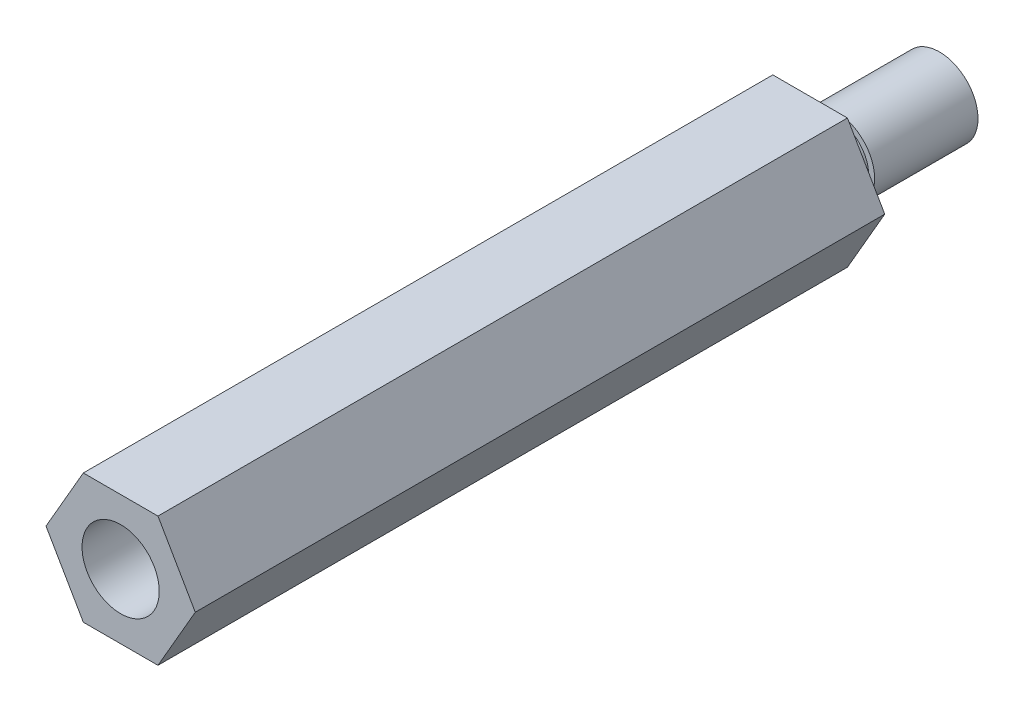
ISO-10303-21;
HEADER;
FILE_DESCRIPTION(('STEP AP214'),'2;1');
FILE_NAME('part.step','',(''),(''),'','','');
FILE_SCHEMA(('AUTOMOTIVE_DESIGN { 1 0 10303 214 1 1 1 1 }'));
ENDSEC;
DATA;
#1=APPLICATION_CONTEXT('core data for automotive mechanical design processes');
#2=APPLICATION_PROTOCOL_DEFINITION('international standard','automotive_design',2000,#1);
#3=PRODUCT_CONTEXT('',#1,'mechanical');
#4=PRODUCT('Part','Part','',(#3));
#5=PRODUCT_RELATED_PRODUCT_CATEGORY('part','',(#4));
#6=PRODUCT_DEFINITION_FORMATION('','',#4);
#7=PRODUCT_DEFINITION_CONTEXT('part definition',#1,'design');
#8=PRODUCT_DEFINITION('design','',#6,#7);
#9=PRODUCT_DEFINITION_SHAPE('','',#8);
#10=(LENGTH_UNIT() NAMED_UNIT(*) SI_UNIT(.MILLI.,.METRE.));
#11=(NAMED_UNIT(*) PLANE_ANGLE_UNIT() SI_UNIT($,.RADIAN.));
#12=(NAMED_UNIT(*) SI_UNIT($,.STERADIAN.) SOLID_ANGLE_UNIT());
#13=UNCERTAINTY_MEASURE_WITH_UNIT(LENGTH_MEASURE(1.E-05),#10,'distance_accuracy_value','');
#14=(GEOMETRIC_REPRESENTATION_CONTEXT(3) GLOBAL_UNCERTAINTY_ASSIGNED_CONTEXT((#13)) GLOBAL_UNIT_ASSIGNED_CONTEXT((#10,
#11,#12)) REPRESENTATION_CONTEXT('',''));
#15=CARTESIAN_POINT('',(0.,0.,0.));
#16=DIRECTION('',(0.,0.,1.));
#17=DIRECTION('',(1.,0.,0.));
#18=AXIS2_PLACEMENT_3D('',#15,#16,#17);
#19=CARTESIAN_POINT('',(-4.12444598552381,-2.38124999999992,0.));
#20=DIRECTION('',(0.,0.,1.));
#21=DIRECTION('',(1.,0.,0.));
#22=AXIS2_PLACEMENT_3D('',#19,#20,#21);
#23=PLANE('',#22);
#24=DIRECTION('',(-0.500000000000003,-0.866025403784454,0.));
#25=VECTOR('',#24,1.);
#26=CARTESIAN_POINT('',(-2.74963065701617,-1.66533453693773E-13,1.66533453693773E-13));
#27=LINE('',#26,#25);
#28=CARTESIAN_POINT('',(-1.37481532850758,2.38124999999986,0.));
#29=VERTEX_POINT('',#28);
#30=CARTESIAN_POINT('',(-2.74963065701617,-1.66533453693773E-13,1.66533453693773E-13));
#31=VERTEX_POINT('',#30);
#32=EDGE_CURVE('E83',#29,#31,#27,.T.);
#33=ORIENTED_EDGE('',*,*,#32,.F.);
#34=DIRECTION('',(-1.,0.,0.));
#35=VECTOR('',#34,1.);
#36=CARTESIAN_POINT('',(-1.37481532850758,2.38124999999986,0.));
#37=LINE('',#36,#35);
#38=CARTESIAN_POINT('',(1.37481532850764,2.38125000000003,1.38777878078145E-13));
#39=VERTEX_POINT('',#38);
#40=EDGE_CURVE('E109',#39,#29,#37,.T.);
#41=ORIENTED_EDGE('',*,*,#40,.F.);
#42=DIRECTION('',(-0.499999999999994,0.866025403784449,0.));
#43=VECTOR('',#42,1.);
#44=CARTESIAN_POINT('',(1.37481532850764,2.38125000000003,1.38777878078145E-13));
#45=LINE('',#44,#43);
#46=CARTESIAN_POINT('',(2.74963065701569,0.,0.));
#47=VERTEX_POINT('',#46);
#48=EDGE_CURVE('E107',#47,#39,#45,.T.);
#49=ORIENTED_EDGE('',*,*,#48,.F.);
#50=DIRECTION('',(0.500000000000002,0.866025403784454,0.));
#51=VECTOR('',#50,1.);
#52=CARTESIAN_POINT('',(2.74963065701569,0.,0.));
#53=LINE('',#52,#51);
#54=CARTESIAN_POINT('',(1.37481532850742,-2.38124999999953,1.80411241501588E-13));
#55=VERTEX_POINT('',#54);
#56=EDGE_CURVE('E105',#55,#47,#53,.T.);
#57=ORIENTED_EDGE('',*,*,#56,.F.);
#58=DIRECTION('',(1.,0.,0.));
#59=VECTOR('',#58,1.);
#60=CARTESIAN_POINT('',(1.37481532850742,-2.38124999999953,1.80411241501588E-13));
#61=LINE('',#60,#59);
#62=CARTESIAN_POINT('',(-1.37481532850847,-2.38124999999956,0.));
#63=VERTEX_POINT('',#62);
#64=EDGE_CURVE('E85',#63,#55,#61,.T.);
#65=ORIENTED_EDGE('',*,*,#64,.F.);
#66=DIRECTION('',(0.499999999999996,-0.866025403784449,0.));
#67=VECTOR('',#66,1.);
#68=CARTESIAN_POINT('',(-1.37481532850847,-2.38124999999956,0.));
#69=LINE('',#68,#67);
#70=EDGE_CURVE('E79',#31,#63,#69,.T.);
#71=ORIENTED_EDGE('',*,*,#70,.F.);
#72=EDGE_LOOP('',(#33,#41,#49,#57,#65,#71));
#73=FACE_BOUND('',#72,.T.);
#74=CARTESIAN_POINT('',(0.,3.05311331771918E-13,0.));
#75=DIRECTION('',(0.,0.,-1.));
#76=DIRECTION('',(-1.,0.,0.));
#77=AXIS2_PLACEMENT_3D('',#74,#75,#76);
#78=CIRCLE('',#77,1.2065);
#79=CARTESIAN_POINT('',(1.20650000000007,2.18193328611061E-13,0.));
#80=VERTEX_POINT('',#79);
#81=EDGE_CURVE('E189',#80,#80,#78,.T.);
#82=ORIENTED_EDGE('',*,*,#81,.F.);
#83=EDGE_LOOP('',(#82));
#84=FACE_BOUND('',#83,.T.);
#85=ADVANCED_FACE('F26',(#73,#84),#23,.F.);
#86=CARTESIAN_POINT('',(-2.74963065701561,-1.66533453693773E-13,25.4000000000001));
#87=DIRECTION('',(0.866025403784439,-0.500000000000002,0.));
#88=DIRECTION('',(0.500000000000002,0.866025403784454,0.));
#89=AXIS2_PLACEMENT_3D('',#86,#87,#88);
#90=PLANE('',#89);
#91=ORIENTED_EDGE('',*,*,#32,.T.);
#92=DIRECTION('',(0.,0.,-1.));
#93=VECTOR('',#92,1.);
#94=CARTESIAN_POINT('',(-2.74963065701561,-1.66533453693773E-13,25.4000000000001));
#95=LINE('',#94,#93);
#96=CARTESIAN_POINT('',(-2.74963065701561,-1.66533453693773E-13,25.4000000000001));
#97=VERTEX_POINT('',#96);
#98=EDGE_CURVE('E11',#97,#31,#95,.T.);
#99=ORIENTED_EDGE('',*,*,#98,.F.);
#100=DIRECTION('',(-0.500000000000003,-0.866025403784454,0.));
#101=VECTOR('',#100,1.);
#102=CARTESIAN_POINT('',(-2.74963065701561,-1.66533453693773E-13,25.4000000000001));
#103=LINE('',#102,#101);
#104=CARTESIAN_POINT('',(-1.37481532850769,2.38125000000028,25.4000000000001));
#105=VERTEX_POINT('',#104);
#106=EDGE_CURVE('E111',#105,#97,#103,.T.);
#107=ORIENTED_EDGE('',*,*,#106,.F.);
#108=DIRECTION('',(0.,0.,-1.));
#109=VECTOR('',#108,1.);
#110=CARTESIAN_POINT('',(-1.37481532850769,2.38125000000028,25.4000000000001));
#111=LINE('',#110,#109);
#112=EDGE_CURVE('E96',#105,#29,#111,.T.);
#113=ORIENTED_EDGE('',*,*,#112,.T.);
#114=EDGE_LOOP('',(#91,#99,#107,#113));
#115=FACE_BOUND('',#114,.T.);
#116=ADVANCED_FACE('F28',(#115),#90,.F.);
#117=CARTESIAN_POINT('',(-1.37481532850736,-2.38124999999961,25.4000000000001));
#118=DIRECTION('',(0.866025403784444,0.500000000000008,0.));
#119=DIRECTION('',(-0.499999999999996,0.866025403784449,0.));
#120=AXIS2_PLACEMENT_3D('',#117,#118,#119);
#121=PLANE('',#120);
#122=ORIENTED_EDGE('',*,*,#70,.T.);
#123=DIRECTION('',(0.,0.,-1.));
#124=VECTOR('',#123,1.);
#125=CARTESIAN_POINT('',(-1.37481532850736,-2.38124999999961,25.4000000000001));
#126=LINE('',#125,#124);
#127=CARTESIAN_POINT('',(-1.37481532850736,-2.38124999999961,25.4000000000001));
#128=VERTEX_POINT('',#127);
#129=EDGE_CURVE('E34',#128,#63,#126,.T.);
#130=ORIENTED_EDGE('',*,*,#129,.F.);
#131=DIRECTION('',(0.499999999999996,-0.866025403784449,0.));
#132=VECTOR('',#131,1.);
#133=CARTESIAN_POINT('',(-1.37481532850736,-2.38124999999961,25.4000000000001));
#134=LINE('',#133,#132);
#135=EDGE_CURVE('E92',#97,#128,#134,.T.);
#136=ORIENTED_EDGE('',*,*,#135,.F.);
#137=ORIENTED_EDGE('',*,*,#98,.T.);
#138=EDGE_LOOP('',(#122,#130,#136,#137));
#139=FACE_BOUND('',#138,.T.);
#140=ADVANCED_FACE('F91',(#139),#121,.F.);
#141=CARTESIAN_POINT('',(1.37481532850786,-2.38124999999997,25.4));
#142=DIRECTION('',(0.,1.00000000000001,0.));
#143=DIRECTION('',(-1.,0.,0.));
#144=AXIS2_PLACEMENT_3D('',#141,#142,#143);
#145=PLANE('',#144);
#146=ORIENTED_EDGE('',*,*,#64,.T.);
#147=DIRECTION('',(0.,0.,-1.));
#148=VECTOR('',#147,1.);
#149=CARTESIAN_POINT('',(1.37481532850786,-2.38124999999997,25.4));
#150=LINE('',#149,#148);
#151=CARTESIAN_POINT('',(1.37481532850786,-2.38124999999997,25.4));
#152=VERTEX_POINT('',#151);
#153=EDGE_CURVE('E127',#152,#55,#150,.T.);
#154=ORIENTED_EDGE('',*,*,#153,.F.);
#155=DIRECTION('',(1.,0.,0.));
#156=VECTOR('',#155,1.);
#157=CARTESIAN_POINT('',(1.37481532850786,-2.38124999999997,25.4));
#158=LINE('',#157,#156);
#159=EDGE_CURVE('E114',#128,#152,#158,.T.);
#160=ORIENTED_EDGE('',*,*,#159,.F.);
#161=ORIENTED_EDGE('',*,*,#129,.T.);
#162=EDGE_LOOP('',(#146,#154,#160,#161));
#163=FACE_BOUND('',#162,.T.);
#164=ADVANCED_FACE('F131',(#163),#145,.F.);
#165=CARTESIAN_POINT('',(2.74963065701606,0.,25.4000000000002));
#166=DIRECTION('',(-0.86602540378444,0.499999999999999,0.));
#167=DIRECTION('',(-0.500000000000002,-0.866025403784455,0.));
#168=AXIS2_PLACEMENT_3D('',#165,#166,#167);
#169=PLANE('',#168);
#170=ORIENTED_EDGE('',*,*,#56,.T.);
#171=DIRECTION('',(0.,0.,-1.));
#172=VECTOR('',#171,1.);
#173=CARTESIAN_POINT('',(2.74963065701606,0.,25.4000000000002));
#174=LINE('',#173,#172);
#175=CARTESIAN_POINT('',(2.74963065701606,0.,25.4000000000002));
#176=VERTEX_POINT('',#175);
#177=EDGE_CURVE('E124',#176,#47,#174,.T.);
#178=ORIENTED_EDGE('',*,*,#177,.F.);
#179=DIRECTION('',(0.500000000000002,0.866025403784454,0.));
#180=VECTOR('',#179,1.);
#181=CARTESIAN_POINT('',(2.74963065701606,0.,25.4000000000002));
#182=LINE('',#181,#180);
#183=EDGE_CURVE('E116',#152,#176,#182,.T.);
#184=ORIENTED_EDGE('',*,*,#183,.F.);
#185=ORIENTED_EDGE('',*,*,#153,.T.);
#186=EDGE_LOOP('',(#170,#178,#184,#185));
#187=FACE_BOUND('',#186,.T.);
#188=ADVANCED_FACE('F137',(#187),#169,.F.);
#189=CARTESIAN_POINT('',(1.37481532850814,2.38124999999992,25.4));
#190=DIRECTION('',(-0.866025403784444,-0.500000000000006,0.));
#191=DIRECTION('',(0.499999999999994,-0.866025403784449,0.));
#192=AXIS2_PLACEMENT_3D('',#189,#190,#191);
#193=PLANE('',#192);
#194=ORIENTED_EDGE('',*,*,#48,.T.);
#195=DIRECTION('',(0.,0.,-1.));
#196=VECTOR('',#195,1.);
#197=CARTESIAN_POINT('',(1.37481532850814,2.38124999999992,25.4));
#198=LINE('',#197,#196);
#199=CARTESIAN_POINT('',(1.37481532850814,2.38124999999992,25.4));
#200=VERTEX_POINT('',#199);
#201=EDGE_CURVE('E121',#200,#39,#198,.T.);
#202=ORIENTED_EDGE('',*,*,#201,.F.);
#203=DIRECTION('',(-0.499999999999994,0.866025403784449,0.));
#204=VECTOR('',#203,1.);
#205=CARTESIAN_POINT('',(1.37481532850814,2.38124999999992,25.4));
#206=LINE('',#205,#204);
#207=EDGE_CURVE('E46',#176,#200,#206,.T.);
#208=ORIENTED_EDGE('',*,*,#207,.F.);
#209=ORIENTED_EDGE('',*,*,#177,.T.);
#210=EDGE_LOOP('',(#194,#202,#208,#209));
#211=FACE_BOUND('',#210,.T.);
#212=ADVANCED_FACE('F140',(#211),#193,.F.);
#213=CARTESIAN_POINT('',(-1.37481532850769,2.38125000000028,25.4000000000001));
#214=DIRECTION('',(0.,-1.00000000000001,0.));
#215=DIRECTION('',(0.,0.,-1.));
#216=AXIS2_PLACEMENT_3D('',#213,#214,#215);
#217=PLANE('',#216);
#218=ORIENTED_EDGE('',*,*,#40,.T.);
#219=ORIENTED_EDGE('',*,*,#112,.F.);
#220=DIRECTION('',(-1.,0.,0.));
#221=VECTOR('',#220,1.);
#222=CARTESIAN_POINT('',(-1.37481532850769,2.38125000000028,25.4000000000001));
#223=LINE('',#222,#221);
#224=EDGE_CURVE('E41',#200,#105,#223,.T.);
#225=ORIENTED_EDGE('',*,*,#224,.F.);
#226=ORIENTED_EDGE('',*,*,#201,.T.);
#227=EDGE_LOOP('',(#218,#219,#225,#226));
#228=FACE_BOUND('',#227,.T.);
#229=ADVANCED_FACE('F142',(#228),#217,.F.);
#230=CARTESIAN_POINT('',(-4.12444598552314,-2.38125,25.4));
#231=DIRECTION('',(0.,0.,1.));
#232=DIRECTION('',(1.,0.,0.));
#233=AXIS2_PLACEMENT_3D('',#230,#231,#232);
#234=PLANE('',#233);
#235=CARTESIAN_POINT('',(5.55111512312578E-13,0.,25.4000000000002));
#236=DIRECTION('',(0.,0.,1.));
#237=DIRECTION('',(1.,0.,0.));
#238=AXIS2_PLACEMENT_3D('',#235,#236,#237);
#239=CIRCLE('',#238,1.4224);
#240=CARTESIAN_POINT('',(1.42240000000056,0.,25.4000000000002));
#241=VERTEX_POINT('',#240);
#242=EDGE_CURVE('E196',#241,#241,#239,.T.);
#243=ORIENTED_EDGE('',*,*,#242,.F.);
#244=EDGE_LOOP('',(#243));
#245=FACE_BOUND('',#244,.T.);
#246=ORIENTED_EDGE('',*,*,#106,.T.);
#247=ORIENTED_EDGE('',*,*,#135,.T.);
#248=ORIENTED_EDGE('',*,*,#159,.T.);
#249=ORIENTED_EDGE('',*,*,#183,.T.);
#250=ORIENTED_EDGE('',*,*,#207,.T.);
#251=ORIENTED_EDGE('',*,*,#224,.T.);
#252=EDGE_LOOP('',(#246,#247,#248,#249,#250,#251));
#253=FACE_BOUND('',#252,.T.);
#254=ADVANCED_FACE('F134',(#245,#253),#234,.T.);
#255=CARTESIAN_POINT('',(1.11022302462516E-13,2.77555756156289E-13,21.4312500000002));
#256=DIRECTION('',(0.,0.,1.));
#257=DIRECTION('',(1.,0.,0.));
#258=AXIS2_PLACEMENT_3D('',#255,#256,#257);
#259=CYLINDRICAL_SURFACE('',#258,1.4224);
#260=CARTESIAN_POINT('',(1.11022302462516E-13,2.77555756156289E-13,21.4312500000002));
#261=DIRECTION('',(0.,0.,1.));
#262=DIRECTION('',(1.,0.,0.));
#263=AXIS2_PLACEMENT_3D('',#260,#261,#262);
#264=CIRCLE('',#263,1.4224);
#265=CARTESIAN_POINT('',(1.42240000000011,2.84267276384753E-13,21.4312500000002));
#266=VERTEX_POINT('',#265);
#267=EDGE_CURVE('E100',#266,#266,#264,.T.);
#268=ORIENTED_EDGE('',*,*,#267,.F.);
#269=EDGE_LOOP('',(#268));
#270=FACE_BOUND('',#269,.T.);
#271=ORIENTED_EDGE('',*,*,#242,.T.);
#272=EDGE_LOOP('',(#271));
#273=FACE_BOUND('',#272,.T.);
#274=ADVANCED_FACE('F149',(#270,#273),#259,.F.);
#275=CARTESIAN_POINT('',(1.11022302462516E-13,2.77555756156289E-13,21.4312500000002));
#276=DIRECTION('',(0.,0.,1.));
#277=DIRECTION('',(1.,0.,0.));
#278=AXIS2_PLACEMENT_3D('',#275,#276,#277);
#279=PLANE('',#278);
#280=ORIENTED_EDGE('',*,*,#267,.T.);
#281=EDGE_LOOP('',(#280));
#282=FACE_BOUND('',#281,.T.);
#283=ADVANCED_FACE('F170',(#282),#279,.T.);
#284=CARTESIAN_POINT('',(0.,2.22044604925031E-13,-0.952499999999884));
#285=DIRECTION('',(0.,0.,-1.));
#286=DIRECTION('',(-1.,0.,0.));
#287=AXIS2_PLACEMENT_3D('',#284,#285,#286);
#288=PLANE('',#287);
#289=CARTESIAN_POINT('',(0.,2.22044604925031E-13,-0.952499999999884));
#290=DIRECTION('',(0.,0.,-1.));
#291=DIRECTION('',(-1.,0.,0.));
#292=AXIS2_PLACEMENT_3D('',#289,#290,#291);
#293=CIRCLE('',#292,1.4224);
#294=CARTESIAN_POINT('',(1.42239999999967,3.57113244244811E-13,-0.952499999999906));
#295=VERTEX_POINT('',#294);
#296=EDGE_CURVE('E191',#295,#295,#293,.T.);
#297=ORIENTED_EDGE('',*,*,#296,.F.);
#298=EDGE_LOOP('',(#297));
#299=FACE_BOUND('',#298,.T.);
#300=CARTESIAN_POINT('',(0.,2.22044604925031E-13,-0.952499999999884));
#301=DIRECTION('',(0.,0.,-1.));
#302=DIRECTION('',(-1.,0.,0.));
#303=AXIS2_PLACEMENT_3D('',#300,#301,#302);
#304=CIRCLE('',#303,1.2065);
#305=CARTESIAN_POINT('',(1.20650000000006,2.27737412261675E-13,-0.952499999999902));
#306=VERTEX_POINT('',#305);
#307=EDGE_CURVE('E186',#306,#306,#304,.T.);
#308=ORIENTED_EDGE('',*,*,#307,.T.);
#309=EDGE_LOOP('',(#308));
#310=FACE_BOUND('',#309,.T.);
#311=ADVANCED_FACE('F174',(#299,#310),#288,.F.);
#312=CARTESIAN_POINT('',(0.,2.22044604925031E-13,-0.952499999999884));
#313=DIRECTION('',(0.,0.,1.));
#314=DIRECTION('',(1.,0.,0.));
#315=AXIS2_PLACEMENT_3D('',#312,#313,#314);
#316=CYLINDRICAL_SURFACE('',#315,1.2065);
#317=CARTESIAN_POINT('',(1.20650000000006,2.27737412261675E-13,-0.952499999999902));
#318=CARTESIAN_POINT('',(1.20650000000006,2.27637994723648E-13,-0.942578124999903));
#319=CARTESIAN_POINT('',(1.20650000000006,2.27538577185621E-13,-0.932656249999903));
#320=CARTESIAN_POINT('',(1.20650000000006,2.27339742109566E-13,-0.912812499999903));
#321=CARTESIAN_POINT('',(1.20650000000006,2.27240324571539E-13,-0.902890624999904));
#322=CARTESIAN_POINT('',(1.20650000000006,2.27041489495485E-13,-0.883046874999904));
#323=CARTESIAN_POINT('',(1.20650000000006,2.26942071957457E-13,-0.873124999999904));
#324=CARTESIAN_POINT('',(1.20650000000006,2.26743236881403E-13,-0.853281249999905));
#325=CARTESIAN_POINT('',(1.20650000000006,2.26643819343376E-13,-0.843359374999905));
#326=CARTESIAN_POINT('',(1.20650000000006,2.26444984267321E-13,-0.823515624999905));
#327=CARTESIAN_POINT('',(1.20650000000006,2.26345566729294E-13,-0.813593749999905));
#328=CARTESIAN_POINT('',(1.20650000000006,2.2614673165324E-13,-0.793749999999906));
#329=CARTESIAN_POINT('',(1.20650000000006,2.26047314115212E-13,-0.783828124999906));
#330=CARTESIAN_POINT('',(1.20650000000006,2.25848479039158E-13,-0.763984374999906));
#331=CARTESIAN_POINT('',(1.20650000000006,2.25749061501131E-13,-0.754062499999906));
#332=CARTESIAN_POINT('',(1.20650000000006,2.25550226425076E-13,-0.734218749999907));
#333=CARTESIAN_POINT('',(1.20650000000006,2.25450808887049E-13,-0.724296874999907));
#334=CARTESIAN_POINT('',(1.20650000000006,2.25251973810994E-13,-0.704453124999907));
#335=CARTESIAN_POINT('',(1.20650000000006,2.25152556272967E-13,-0.694531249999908));
#336=CARTESIAN_POINT('',(1.20650000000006,2.24953721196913E-13,-0.674687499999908));
#337=CARTESIAN_POINT('',(1.20650000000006,2.24854303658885E-13,-0.664765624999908));
#338=CARTESIAN_POINT('',(1.20650000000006,2.24655468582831E-13,-0.644921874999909));
#339=CARTESIAN_POINT('',(1.20650000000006,2.24556051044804E-13,-0.634999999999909));
#340=CARTESIAN_POINT('',(1.20650000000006,2.24357215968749E-13,-0.615156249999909));
#341=CARTESIAN_POINT('',(1.20650000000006,2.24257798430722E-13,-0.605234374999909));
#342=CARTESIAN_POINT('',(1.20650000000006,2.24058963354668E-13,-0.58539062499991));
#343=CARTESIAN_POINT('',(1.20650000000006,2.2395954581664E-13,-0.57546874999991));
#344=CARTESIAN_POINT('',(1.20650000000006,2.23760710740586E-13,-0.55562499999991));
#345=CARTESIAN_POINT('',(1.20650000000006,2.23661293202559E-13,-0.545703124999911));
#346=CARTESIAN_POINT('',(1.20650000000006,2.23462458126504E-13,-0.525859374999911));
#347=CARTESIAN_POINT('',(1.20650000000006,2.23363040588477E-13,-0.515937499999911));
#348=CARTESIAN_POINT('',(1.20650000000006,2.23164205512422E-13,-0.496093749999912));
#349=CARTESIAN_POINT('',(1.20650000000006,2.23064787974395E-13,-0.486171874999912));
#350=CARTESIAN_POINT('',(1.20650000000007,2.22865952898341E-13,-0.466328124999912));
#351=CARTESIAN_POINT('',(1.20650000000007,2.22766535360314E-13,-0.456406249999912));
#352=CARTESIAN_POINT('',(1.20650000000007,2.22567700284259E-13,-0.436562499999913));
#353=CARTESIAN_POINT('',(1.20650000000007,2.22468282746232E-13,-0.426640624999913));
#354=CARTESIAN_POINT('',(1.20650000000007,2.22269447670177E-13,-0.406796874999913));
#355=CARTESIAN_POINT('',(1.20650000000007,2.2217003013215E-13,-0.396874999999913));
#356=CARTESIAN_POINT('',(1.20650000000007,2.21971195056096E-13,-0.377031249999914));
#357=CARTESIAN_POINT('',(1.20650000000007,2.21871777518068E-13,-0.367109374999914));
#358=CARTESIAN_POINT('',(1.20650000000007,2.21672942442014E-13,-0.347265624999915));
#359=CARTESIAN_POINT('',(1.20650000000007,2.21573524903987E-13,-0.337343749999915));
#360=CARTESIAN_POINT('',(1.20650000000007,2.21374689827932E-13,-0.317499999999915));
#361=CARTESIAN_POINT('',(1.20650000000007,2.21275272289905E-13,-0.307578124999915));
#362=CARTESIAN_POINT('',(1.20650000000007,2.21076437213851E-13,-0.287734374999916));
#363=CARTESIAN_POINT('',(1.20650000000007,2.20977019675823E-13,-0.277812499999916));
#364=CARTESIAN_POINT('',(1.20650000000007,2.20778184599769E-13,-0.257968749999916));
#365=CARTESIAN_POINT('',(1.20650000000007,2.20678767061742E-13,-0.248046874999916));
#366=CARTESIAN_POINT('',(1.20650000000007,2.20479931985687E-13,-0.228203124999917));
#367=CARTESIAN_POINT('',(1.20650000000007,2.2038051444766E-13,-0.218281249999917));
#368=CARTESIAN_POINT('',(1.20650000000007,2.20181679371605E-13,-0.198437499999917));
#369=CARTESIAN_POINT('',(1.20650000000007,2.20082261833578E-13,-0.188515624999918));
#370=CARTESIAN_POINT('',(1.20650000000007,2.19883426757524E-13,-0.168671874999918));
#371=CARTESIAN_POINT('',(1.20650000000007,2.19784009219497E-13,-0.158749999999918));
#372=CARTESIAN_POINT('',(1.20650000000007,2.19585174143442E-13,-0.138906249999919));
#373=CARTESIAN_POINT('',(1.20650000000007,2.19485756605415E-13,-0.128984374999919));
#374=CARTESIAN_POINT('',(1.20650000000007,2.1928692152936E-13,-0.109140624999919));
#375=CARTESIAN_POINT('',(1.20650000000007,2.19187503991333E-13,-0.0992187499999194));
#376=CARTESIAN_POINT('',(1.20650000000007,2.18988668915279E-13,-0.0793749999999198));
#377=CARTESIAN_POINT('',(1.20650000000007,2.18889251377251E-13,-0.06945312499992));
#378=CARTESIAN_POINT('',(1.20650000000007,2.18690416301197E-13,-0.0496093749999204));
#379=CARTESIAN_POINT('',(1.20650000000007,2.1859099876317E-13,-0.0396874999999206));
#380=CARTESIAN_POINT('',(1.20650000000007,2.18392163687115E-13,-0.019843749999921));
#381=CARTESIAN_POINT('',(1.20650000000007,2.18292746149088E-13,-0.00992187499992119));
#382=CARTESIAN_POINT('',(1.20650000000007,2.18193328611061E-13,0.));
#383=B_SPLINE_CURVE_WITH_KNOTS('',3,(#317,#318,#319,#320,#321,#322,#323,#324,#325,#326,#327,
#328,#329,#330,#331,#332,#333,#334,#335,#336,#337,#338,#339,#340,#341,#342,#343,#344,#345,#346,
#347,#348,#349,#350,#351,#352,#353,#354,#355,#356,#357,#358,#359,#360,#361,#362,#363,#364,#365,
#366,#367,#368,#369,#370,#371,#372,#373,#374,#375,#376,#377,#378,#379,#380,#381,#382),
.UNSPECIFIED.,.F.,.F.,(4,2,2,2,2,2,2,2,2,2,2,2,2,2,2,2,2,2,2,2,2,2,2,2,2,2,2,2,2,2,2,2,4),(0.,
0.0297656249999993,0.0595312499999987,0.0892968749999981,0.119062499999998,0.148828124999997,
0.178593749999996,0.208359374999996,0.238124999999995,0.267890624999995,0.297656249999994,
0.327421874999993,0.357187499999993,0.386953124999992,0.416718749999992,0.446484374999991,
0.47624999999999,0.50601562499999,0.535781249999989,0.565546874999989,0.595312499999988,
0.625078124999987,0.654843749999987,0.684609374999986,0.714374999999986,0.744140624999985,
0.773906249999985,0.803671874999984,0.833437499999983,0.863203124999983,0.892968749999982,
0.922734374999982,0.952499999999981),.UNSPECIFIED.);
#384=EDGE_CURVE('BSEAM166',#306,#80,#383,.T.);
#385=ORIENTED_EDGE('',*,*,#307,.F.);
#386=ORIENTED_EDGE('',*,*,#81,.T.);
#387=ORIENTED_EDGE('',*,*,#384,.T.);
#388=ORIENTED_EDGE('',*,*,#384,.F.);
#389=EDGE_LOOP('',(#385,#387,#386,#388));
#390=FACE_BOUND('',#389,.T.);
#391=ADVANCED_FACE('F166',(#390),#316,.T.);
#392=CARTESIAN_POINT('',(-3.88578058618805E-13,3.88578058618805E-13,-4.76249999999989));
#393=DIRECTION('',(0.,0.,-1.));
#394=DIRECTION('',(-1.,0.,0.));
#395=AXIS2_PLACEMENT_3D('',#392,#393,#394);
#396=PLANE('',#395);
#397=CARTESIAN_POINT('',(-3.88578058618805E-13,3.88578058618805E-13,-4.76249999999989));
#398=DIRECTION('',(0.,0.,-1.));
#399=DIRECTION('',(-1.,0.,0.));
#400=AXIS2_PLACEMENT_3D('',#397,#398,#399);
#401=CIRCLE('',#400,1.4224);
#402=CARTESIAN_POINT('',(1.42239999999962,3.95289578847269E-13,-4.76249999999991));
#403=VERTEX_POINT('',#402);
#404=EDGE_CURVE('E97',#403,#403,#401,.T.);
#405=ORIENTED_EDGE('',*,*,#404,.T.);
#406=EDGE_LOOP('',(#405));
#407=FACE_BOUND('',#406,.T.);
#408=ADVANCED_FACE('F162',(#407),#396,.T.);
#409=CARTESIAN_POINT('',(-3.88578058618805E-13,3.88578058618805E-13,-4.76249999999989));
#410=DIRECTION('',(0.,0.,1.));
#411=DIRECTION('',(1.,0.,0.));
#412=AXIS2_PLACEMENT_3D('',#409,#410,#411);
#413=CYLINDRICAL_SURFACE('',#412,1.4224);
#414=CARTESIAN_POINT('',(1.42239999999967,3.57113244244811E-13,-0.952499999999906));
#415=CARTESIAN_POINT('',(1.42239999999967,3.57510914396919E-13,-0.992187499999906));
#416=CARTESIAN_POINT('',(1.42239999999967,3.57908584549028E-13,-1.03187499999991));
#417=CARTESIAN_POINT('',(1.42239999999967,3.58703924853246E-13,-1.11124999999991));
#418=CARTESIAN_POINT('',(1.42239999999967,3.59101595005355E-13,-1.15093749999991));
#419=CARTESIAN_POINT('',(1.42239999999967,3.59896935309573E-13,-1.23031249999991));
#420=CARTESIAN_POINT('',(1.42239999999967,3.60294605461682E-13,-1.26999999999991));
#421=CARTESIAN_POINT('',(1.42239999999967,3.610899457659E-13,-1.34937499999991));
#422=CARTESIAN_POINT('',(1.42239999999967,3.61487615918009E-13,-1.38906249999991));
#423=CARTESIAN_POINT('',(1.42239999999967,3.62282956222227E-13,-1.46843749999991));
#424=CARTESIAN_POINT('',(1.42239999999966,3.62680626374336E-13,-1.50812499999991));
#425=CARTESIAN_POINT('',(1.42239999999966,3.63475966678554E-13,-1.58749999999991));
#426=CARTESIAN_POINT('',(1.42239999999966,3.63873636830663E-13,-1.62718749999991));
#427=CARTESIAN_POINT('',(1.42239999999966,3.6466897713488E-13,-1.70656249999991));
#428=CARTESIAN_POINT('',(1.42239999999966,3.65066647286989E-13,-1.74624999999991));
#429=CARTESIAN_POINT('',(1.42239999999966,3.65861987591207E-13,-1.82562499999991));
#430=CARTESIAN_POINT('',(1.42239999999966,3.66259657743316E-13,-1.86531249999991));
#431=CARTESIAN_POINT('',(1.42239999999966,3.67054998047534E-13,-1.94468749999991));
#432=CARTESIAN_POINT('',(1.42239999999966,3.67452668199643E-13,-1.98437499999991));
#433=CARTESIAN_POINT('',(1.42239999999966,3.68248008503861E-13,-2.06374999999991));
#434=CARTESIAN_POINT('',(1.42239999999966,3.6864567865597E-13,-2.10343749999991));
#435=CARTESIAN_POINT('',(1.42239999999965,3.69441018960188E-13,-2.18281249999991));
#436=CARTESIAN_POINT('',(1.42239999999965,3.69838689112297E-13,-2.22249999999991));
#437=CARTESIAN_POINT('',(1.42239999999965,3.70634029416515E-13,-2.30187499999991));
#438=CARTESIAN_POINT('',(1.42239999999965,3.71031699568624E-13,-2.34156249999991));
#439=CARTESIAN_POINT('',(1.42239999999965,3.71827039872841E-13,-2.42093749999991));
#440=CARTESIAN_POINT('',(1.42239999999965,3.7222471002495E-13,-2.46062499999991));
#441=CARTESIAN_POINT('',(1.42239999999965,3.73020050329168E-13,-2.53999999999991));
#442=CARTESIAN_POINT('',(1.42239999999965,3.73417720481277E-13,-2.57968749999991));
#443=CARTESIAN_POINT('',(1.42239999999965,3.74213060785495E-13,-2.65906249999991));
#444=CARTESIAN_POINT('',(1.42239999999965,3.74610730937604E-13,-2.69874999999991));
#445=CARTESIAN_POINT('',(1.42239999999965,3.75406071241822E-13,-2.77812499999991));
#446=CARTESIAN_POINT('',(1.42239999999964,3.75803741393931E-13,-2.81781249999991));
#447=CARTESIAN_POINT('',(1.42239999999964,3.76599081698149E-13,-2.89718749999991));
#448=CARTESIAN_POINT('',(1.42239999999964,3.76996751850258E-13,-2.93687499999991));
#449=CARTESIAN_POINT('',(1.42239999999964,3.77792092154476E-13,-3.01624999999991));
#450=CARTESIAN_POINT('',(1.42239999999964,3.78189762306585E-13,-3.05593749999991));
#451=CARTESIAN_POINT('',(1.42239999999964,3.78985102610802E-13,-3.13531249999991));
#452=CARTESIAN_POINT('',(1.42239999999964,3.79382772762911E-13,-3.17499999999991));
#453=CARTESIAN_POINT('',(1.42239999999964,3.80178113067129E-13,-3.25437499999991));
#454=CARTESIAN_POINT('',(1.42239999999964,3.80575783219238E-13,-3.29406249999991));
#455=CARTESIAN_POINT('',(1.42239999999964,3.81371123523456E-13,-3.37343749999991));
#456=CARTESIAN_POINT('',(1.42239999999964,3.81768793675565E-13,-3.41312499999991));
#457=CARTESIAN_POINT('',(1.42239999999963,3.82564133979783E-13,-3.49249999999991));
#458=CARTESIAN_POINT('',(1.42239999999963,3.82961804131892E-13,-3.53218749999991));
#459=CARTESIAN_POINT('',(1.42239999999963,3.8375714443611E-13,-3.61156249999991));
#460=CARTESIAN_POINT('',(1.42239999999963,3.84154814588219E-13,-3.65124999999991));
#461=CARTESIAN_POINT('',(1.42239999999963,3.84950154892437E-13,-3.73062499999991));
#462=CARTESIAN_POINT('',(1.42239999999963,3.85347825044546E-13,-3.77031249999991));
#463=CARTESIAN_POINT('',(1.42239999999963,3.86143165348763E-13,-3.84968749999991));
#464=CARTESIAN_POINT('',(1.42239999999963,3.86540835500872E-13,-3.88937499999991));
#465=CARTESIAN_POINT('',(1.42239999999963,3.8733617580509E-13,-3.96874999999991));
#466=CARTESIAN_POINT('',(1.42239999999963,3.87733845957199E-13,-4.00843749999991));
#467=CARTESIAN_POINT('',(1.42239999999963,3.88529186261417E-13,-4.08781249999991));
#468=CARTESIAN_POINT('',(1.42239999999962,3.88926856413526E-13,-4.12749999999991));
#469=CARTESIAN_POINT('',(1.42239999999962,3.89722196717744E-13,-4.20687499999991));
#470=CARTESIAN_POINT('',(1.42239999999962,3.90119866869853E-13,-4.24656249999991));
#471=CARTESIAN_POINT('',(1.42239999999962,3.90915207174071E-13,-4.32593749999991));
#472=CARTESIAN_POINT('',(1.42239999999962,3.9131287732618E-13,-4.36562499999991));
#473=CARTESIAN_POINT('',(1.42239999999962,3.92108217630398E-13,-4.44499999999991));
#474=CARTESIAN_POINT('',(1.42239999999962,3.92505887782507E-13,-4.48468749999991));
#475=CARTESIAN_POINT('',(1.42239999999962,3.93301228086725E-13,-4.56406249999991));
#476=CARTESIAN_POINT('',(1.42239999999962,3.93698898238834E-13,-4.60374999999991));
#477=CARTESIAN_POINT('',(1.42239999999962,3.94494238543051E-13,-4.68312499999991));
#478=CARTESIAN_POINT('',(1.42239999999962,3.9489190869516E-13,-4.72281249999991));
#479=CARTESIAN_POINT('',(1.42239999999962,3.95289578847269E-13,-4.76249999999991));
#480=B_SPLINE_CURVE_WITH_KNOTS('',3,(#414,#415,#416,#417,#418,#419,#420,#421,#422,#423,#424,
#425,#426,#427,#428,#429,#430,#431,#432,#433,#434,#435,#436,#437,#438,#439,#440,#441,#442,#443,
#444,#445,#446,#447,#448,#449,#450,#451,#452,#453,#454,#455,#456,#457,#458,#459,#460,#461,#462,
#463,#464,#465,#466,#467,#468,#469,#470,#471,#472,#473,#474,#475,#476,#477,#478,#479),
.UNSPECIFIED.,.F.,.F.,(4,2,2,2,2,2,2,2,2,2,2,2,2,2,2,2,2,2,2,2,2,2,2,2,2,2,2,2,2,2,2,2,4),(0.,
0.1190625,0.238125,0.357187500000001,0.476250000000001,0.595312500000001,0.714375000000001,
0.833437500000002,0.952500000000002,1.0715625,1.190625,1.3096875,1.42875,1.5478125,1.666875,
1.7859375,1.905,2.0240625,2.143125,2.2621875,2.38125000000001,2.50031250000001,2.61937500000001,
2.73843750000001,2.85750000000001,2.97656250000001,3.09562500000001,3.21468750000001,
3.33375000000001,3.45281250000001,3.57187500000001,3.69093750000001,3.81000000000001),.UNSPECIFIED.);
#481=EDGE_CURVE('BSEAM159',#295,#403,#480,.T.);
#482=ORIENTED_EDGE('',*,*,#296,.T.);
#483=ORIENTED_EDGE('',*,*,#404,.F.);
#484=ORIENTED_EDGE('',*,*,#481,.T.);
#485=ORIENTED_EDGE('',*,*,#481,.F.);
#486=EDGE_LOOP('',(#482,#484,#483,#485));
#487=FACE_BOUND('',#486,.T.);
#488=ADVANCED_FACE('F159',(#487),#413,.T.);
#489=CLOSED_SHELL('',(#85,#116,#140,#164,#188,#212,#229,#254,#274,#283,#311,#391,#408,#488));
#490=MANIFOLD_SOLID_BREP('B2',#489);
#491=ADVANCED_BREP_SHAPE_REPRESENTATION('',(#18,#490),#14);
#492=SHAPE_DEFINITION_REPRESENTATION(#9,#491);
ENDSEC;
END-ISO-10303-21;
